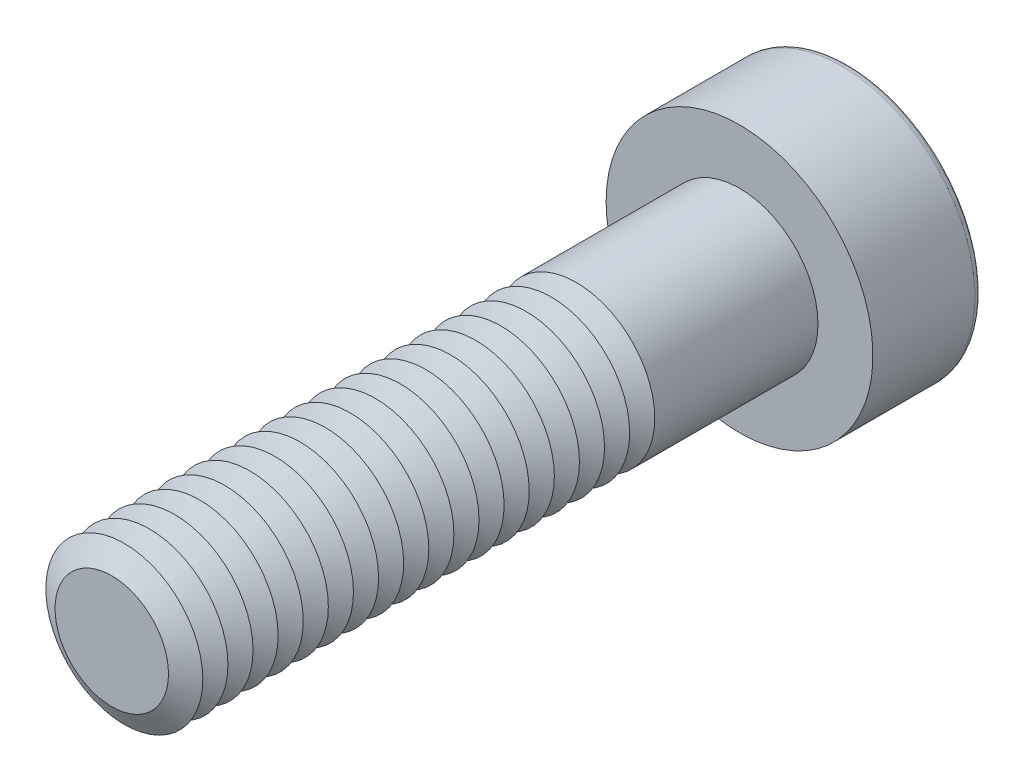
from build123d import *

# Parameters (mm, degrees)
SKETCH1_R           = 2.5
BOSS_EXTRUDE1_DEPTH = 20
SKETCH2_R           = 4.25
BOSS_EXTRUDE2_DEPTH = 3.5
CUT_EXTRUDE1_DEPTH  = 2.25
FILLET1_R           = 0.25
LPATTERN1_COUNT     = 19
LPATTERN1_PITCH     = 0.8


with BuildPart() as part:
    # Sketch1 → Boss-Extrude1 (new body)
    with BuildSketch(Plane.XY):
        Circle(SKETCH1_R)
    extrude(amount=BOSS_EXTRUDE1_DEPTH)

    # Sketch2 → Boss-Extrude2 (add)
    with BuildSketch(Plane(origin=(0, 0, 0), x_dir=(-1, 0, 0), z_dir=(0, 0, -1))):
        Circle(SKETCH2_R)
    extrude(amount=BOSS_EXTRUDE2_DEPTH)

    # Sketch3 → Cut-Extrude1 (cut)
    with BuildSketch(Plane(origin=(0, 0, -3.5), x_dir=(-1, 0, 0), z_dir=(0, 0, -1))):
        Polygon((-0.866025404, 1.5), (-1.732050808, 0), (-0.866025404, -1.5), (0.866025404, -1.5), (1.732050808, 0), (0.866025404, 1.5), align=None)
    extrude(amount=-CUT_EXTRUDE1_DEPTH, mode=Mode.SUBTRACT)

    # Fillet1
    fillet1_edges = [part.edges().sort_by_distance(p)[0] for p in [
        (4.25, 0, -3.5),
    ]]
    fillet(fillet1_edges, radius=FILLET1_R)

    # Cut-Extrude2 cone 1 section (on through the dimple's axis) → Cut-Extrude2 (revolve, cut)
    with BuildSketch(Plane(origin=(0, 0, -1.25), x_dir=(0, 1, 0), z_dir=(1, 0, 0))):
        Polygon((0, 0), (1.5, 0), (0, 0.866025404), align=None)
    revolve(axis=Axis((0, 0, -1.25), (0, 0, 1)), mode=Mode.SUBTRACT)

    # Cut-Extrude3 cone 1 section (on through the dimple's axis) → Cut-Extrude3 (revolve, cut)
    with BuildSketch(Plane(origin=(0, 0, -3.5), x_dir=(0, 1, 0), z_dir=(1, 0, 0))):
        Polygon((0, 0), (1.732050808, 0), (0, 0.464101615), align=None)
    revolve(axis=Axis((0, 0, -3.5), (0, 0, 1)), mode=Mode.SUBTRACT)

    # Sketch7 → Cut-Revolve1 (revolve, cut)
    with BuildSketch(Plane(origin=(0, 0, 0), x_dir=(0, 0, -1), z_dir=(1, 0, 0)), mode=Mode.PRIVATE) as cut_revolve1_sk:
        Polygon((-20, 1.807179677), (-19.6, 2.5), (-20.4, 2.5), align=None)
    cut_revolve1 = revolve(cut_revolve1_sk.sketch.rotate(Axis((0, 0, 20), (0, 0, -1)), 90), axis=Axis((0, 0, 20), (0, 0, -1)), mode=Mode.SUBTRACT)

    # LPattern1: Cut-Revolve1 ×19
    with Locations(*[(0, 0, -i * LPATTERN1_PITCH) for i in range(1, LPATTERN1_COUNT)]):
        add(cut_revolve1, mode=Mode.SUBTRACT)


solid = part.part
